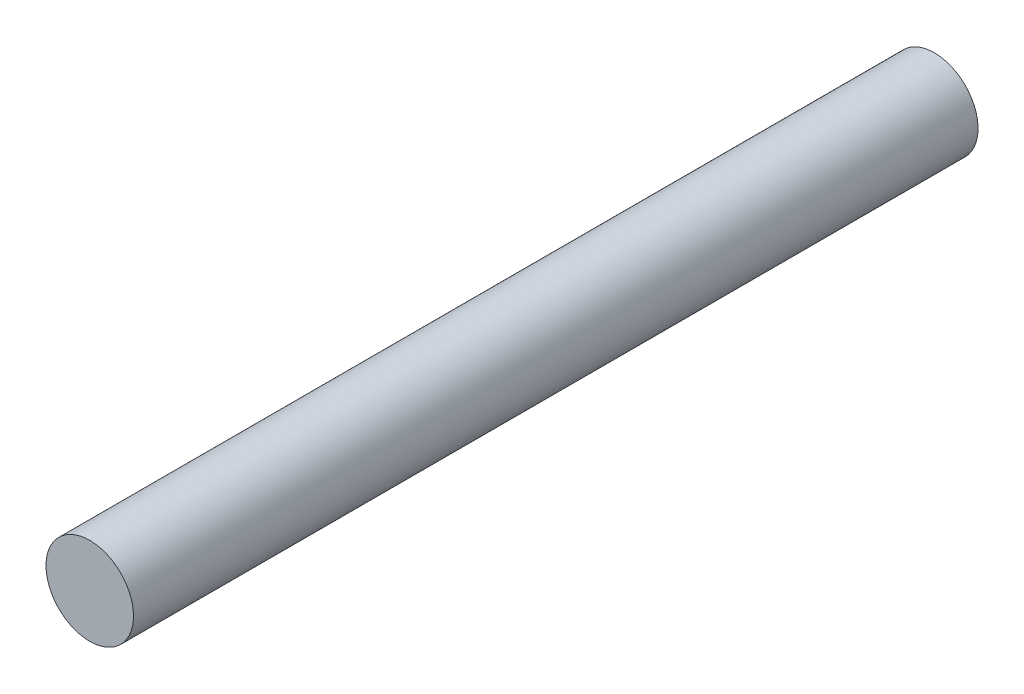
ISO-10303-21;
HEADER;
FILE_DESCRIPTION(('STEP AP214'),'2;1');
FILE_NAME('part.step','',(''),(''),'','','');
FILE_SCHEMA(('AUTOMOTIVE_DESIGN { 1 0 10303 214 1 1 1 1 }'));
ENDSEC;
DATA;
#1=APPLICATION_CONTEXT('core data for automotive mechanical design processes');
#2=APPLICATION_PROTOCOL_DEFINITION('international standard','automotive_design',2000,#1);
#3=PRODUCT_CONTEXT('',#1,'mechanical');
#4=PRODUCT('Part','Part','',(#3));
#5=PRODUCT_RELATED_PRODUCT_CATEGORY('part','',(#4));
#6=PRODUCT_DEFINITION_FORMATION('','',#4);
#7=PRODUCT_DEFINITION_CONTEXT('part definition',#1,'design');
#8=PRODUCT_DEFINITION('design','',#6,#7);
#9=PRODUCT_DEFINITION_SHAPE('','',#8);
#10=(LENGTH_UNIT() NAMED_UNIT(*) SI_UNIT(.MILLI.,.METRE.));
#11=(NAMED_UNIT(*) PLANE_ANGLE_UNIT() SI_UNIT($,.RADIAN.));
#12=(NAMED_UNIT(*) SI_UNIT($,.STERADIAN.) SOLID_ANGLE_UNIT());
#13=UNCERTAINTY_MEASURE_WITH_UNIT(LENGTH_MEASURE(1.E-05),#10,'distance_accuracy_value','');
#14=(GEOMETRIC_REPRESENTATION_CONTEXT(3) GLOBAL_UNCERTAINTY_ASSIGNED_CONTEXT((#13)) GLOBAL_UNIT_ASSIGNED_CONTEXT((#10,
#11,#12)) REPRESENTATION_CONTEXT('',''));
#15=CARTESIAN_POINT('',(0.,0.,0.));
#16=DIRECTION('',(0.,0.,1.));
#17=DIRECTION('',(1.,0.,0.));
#18=AXIS2_PLACEMENT_3D('',#15,#16,#17);
#19=CARTESIAN_POINT('',(0.,0.,30.4));
#20=DIRECTION('',(0.,0.,-1.));
#21=DIRECTION('',(-1.,0.,0.));
#22=AXIS2_PLACEMENT_3D('',#19,#20,#21);
#23=CYLINDRICAL_SURFACE('',#22,3.15);
#24=CARTESIAN_POINT('',(0.,0.,30.4));
#25=DIRECTION('',(0.,0.,1.));
#26=DIRECTION('',(1.,0.,0.));
#27=AXIS2_PLACEMENT_3D('',#24,#25,#26);
#28=CIRCLE('',#27,3.15);
#29=CARTESIAN_POINT('',(-3.15,0.,30.4));
#30=VERTEX_POINT('',#29);
#31=EDGE_CURVE('E10',#30,#30,#28,.T.);
#32=CARTESIAN_POINT('',(0.,0.,-30.4));
#33=DIRECTION('',(0.,0.,1.));
#34=DIRECTION('',(1.,0.,0.));
#35=AXIS2_PLACEMENT_3D('',#32,#33,#34);
#36=CIRCLE('',#35,3.15);
#37=CARTESIAN_POINT('',(-3.15,0.,-30.4));
#38=VERTEX_POINT('',#37);
#39=EDGE_CURVE('E37',#38,#38,#36,.T.);
#40=CARTESIAN_POINT('',(-3.15,0.,30.4));
#41=CARTESIAN_POINT('',(-3.15,0.,29.7666666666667));
#42=CARTESIAN_POINT('',(-3.15,0.,29.1333333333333));
#43=CARTESIAN_POINT('',(-3.15,0.,27.8666666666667));
#44=CARTESIAN_POINT('',(-3.15,0.,27.2333333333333));
#45=CARTESIAN_POINT('',(-3.15,0.,25.9666666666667));
#46=CARTESIAN_POINT('',(-3.15,0.,25.3333333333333));
#47=CARTESIAN_POINT('',(-3.15,0.,24.0666666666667));
#48=CARTESIAN_POINT('',(-3.15,0.,23.4333333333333));
#49=CARTESIAN_POINT('',(-3.15,0.,22.1666666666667));
#50=CARTESIAN_POINT('',(-3.15,0.,21.5333333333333));
#51=CARTESIAN_POINT('',(-3.15,0.,20.2666666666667));
#52=CARTESIAN_POINT('',(-3.15,0.,19.6333333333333));
#53=CARTESIAN_POINT('',(-3.15,0.,18.3666666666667));
#54=CARTESIAN_POINT('',(-3.15,0.,17.7333333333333));
#55=CARTESIAN_POINT('',(-3.15,0.,16.4666666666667));
#56=CARTESIAN_POINT('',(-3.15,0.,15.8333333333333));
#57=CARTESIAN_POINT('',(-3.15,0.,14.5666666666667));
#58=CARTESIAN_POINT('',(-3.15,0.,13.9333333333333));
#59=CARTESIAN_POINT('',(-3.15,0.,12.6666666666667));
#60=CARTESIAN_POINT('',(-3.15,0.,12.0333333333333));
#61=CARTESIAN_POINT('',(-3.15,0.,10.7666666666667));
#62=CARTESIAN_POINT('',(-3.15,0.,10.1333333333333));
#63=CARTESIAN_POINT('',(-3.15,0.,8.86666666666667));
#64=CARTESIAN_POINT('',(-3.15,0.,8.23333333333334));
#65=CARTESIAN_POINT('',(-3.15,0.,6.96666666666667));
#66=CARTESIAN_POINT('',(-3.15,0.,6.33333333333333));
#67=CARTESIAN_POINT('',(-3.15,0.,5.06666666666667));
#68=CARTESIAN_POINT('',(-3.15,0.,4.43333333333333));
#69=CARTESIAN_POINT('',(-3.15,0.,3.16666666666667));
#70=CARTESIAN_POINT('',(-3.15,0.,2.53333333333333));
#71=CARTESIAN_POINT('',(-3.15,0.,1.26666666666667));
#72=CARTESIAN_POINT('',(-3.15,0.,0.633333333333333));
#73=CARTESIAN_POINT('',(-3.15,0.,-0.633333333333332));
#74=CARTESIAN_POINT('',(-3.15,0.,-1.26666666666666));
#75=CARTESIAN_POINT('',(-3.15,0.,-2.53333333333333));
#76=CARTESIAN_POINT('',(-3.15,0.,-3.16666666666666));
#77=CARTESIAN_POINT('',(-3.15,0.,-4.43333333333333));
#78=CARTESIAN_POINT('',(-3.15,0.,-5.06666666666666));
#79=CARTESIAN_POINT('',(-3.15,0.,-6.33333333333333));
#80=CARTESIAN_POINT('',(-3.15,0.,-6.96666666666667));
#81=CARTESIAN_POINT('',(-3.15,0.,-8.23333333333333));
#82=CARTESIAN_POINT('',(-3.15,0.,-8.86666666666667));
#83=CARTESIAN_POINT('',(-3.15,0.,-10.1333333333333));
#84=CARTESIAN_POINT('',(-3.15,0.,-10.7666666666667));
#85=CARTESIAN_POINT('',(-3.15,0.,-12.0333333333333));
#86=CARTESIAN_POINT('',(-3.15,0.,-12.6666666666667));
#87=CARTESIAN_POINT('',(-3.15,0.,-13.9333333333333));
#88=CARTESIAN_POINT('',(-3.15,0.,-14.5666666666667));
#89=CARTESIAN_POINT('',(-3.15,0.,-15.8333333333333));
#90=CARTESIAN_POINT('',(-3.15,0.,-16.4666666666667));
#91=CARTESIAN_POINT('',(-3.15,0.,-17.7333333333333));
#92=CARTESIAN_POINT('',(-3.15,0.,-18.3666666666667));
#93=CARTESIAN_POINT('',(-3.15,0.,-19.6333333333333));
#94=CARTESIAN_POINT('',(-3.15,0.,-20.2666666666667));
#95=CARTESIAN_POINT('',(-3.15,0.,-21.5333333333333));
#96=CARTESIAN_POINT('',(-3.15,0.,-22.1666666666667));
#97=CARTESIAN_POINT('',(-3.15,0.,-23.4333333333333));
#98=CARTESIAN_POINT('',(-3.15,0.,-24.0666666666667));
#99=CARTESIAN_POINT('',(-3.15,0.,-25.3333333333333));
#100=CARTESIAN_POINT('',(-3.15,0.,-25.9666666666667));
#101=CARTESIAN_POINT('',(-3.15,0.,-27.2333333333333));
#102=CARTESIAN_POINT('',(-3.15,0.,-27.8666666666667));
#103=CARTESIAN_POINT('',(-3.15,0.,-29.1333333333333));
#104=CARTESIAN_POINT('',(-3.15,0.,-29.7666666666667));
#105=CARTESIAN_POINT('',(-3.15,0.,-30.4));
#106=B_SPLINE_CURVE_WITH_KNOTS('',3,(#40,#41,#42,#43,#44,#45,#46,#47,#48,#49,#50,#51,#52,#53,
#54,#55,#56,#57,#58,#59,#60,#61,#62,#63,#64,#65,#66,#67,#68,#69,#70,#71,#72,#73,#74,#75,#76,#77,
#78,#79,#80,#81,#82,#83,#84,#85,#86,#87,#88,#89,#90,#91,#92,#93,#94,#95,#96,#97,#98,#99,#100,
#101,#102,#103,#104,#105),.UNSPECIFIED.,.F.,.F.,(4,2,2,2,2,2,2,2,2,2,2,2,2,2,2,2,2,2,2,2,2,2,2,
2,2,2,2,2,2,2,2,2,4),(0.,1.9,3.8,5.7,7.6,9.5,11.4,13.3,15.2,17.1,19.,20.9,22.8,24.7,26.6,28.5,
30.4,32.3,34.2,36.1,38.,39.9,41.8,43.7,45.6,47.5,49.4,51.3,53.2,55.1,57.,58.9,60.8),.UNSPECIFIED.);
#107=EDGE_CURVE('BSEAM34',#30,#38,#106,.T.);
#108=ORIENTED_EDGE('',*,*,#31,.F.);
#109=ORIENTED_EDGE('',*,*,#39,.T.);
#110=ORIENTED_EDGE('',*,*,#107,.T.);
#111=ORIENTED_EDGE('',*,*,#107,.F.);
#112=EDGE_LOOP('',(#108,#110,#109,#111));
#113=FACE_BOUND('',#112,.T.);
#114=ADVANCED_FACE('F34',(#113),#23,.T.);
#115=CARTESIAN_POINT('',(0.,0.,30.4));
#116=DIRECTION('',(0.,0.,1.));
#117=DIRECTION('',(1.,0.,0.));
#118=AXIS2_PLACEMENT_3D('',#115,#116,#117);
#119=PLANE('',#118);
#120=ORIENTED_EDGE('',*,*,#31,.T.);
#121=EDGE_LOOP('',(#120));
#122=FACE_BOUND('',#121,.T.);
#123=ADVANCED_FACE('F49',(#122),#119,.T.);
#124=CARTESIAN_POINT('',(0.,0.,-30.4));
#125=DIRECTION('',(0.,0.,1.));
#126=DIRECTION('',(1.,0.,0.));
#127=AXIS2_PLACEMENT_3D('',#124,#125,#126);
#128=PLANE('',#127);
#129=ORIENTED_EDGE('',*,*,#39,.F.);
#130=EDGE_LOOP('',(#129));
#131=FACE_BOUND('',#130,.T.);
#132=ADVANCED_FACE('F47',(#131),#128,.F.);
#133=CLOSED_SHELL('',(#114,#123,#132));
#134=MANIFOLD_SOLID_BREP('B2',#133);
#135=ADVANCED_BREP_SHAPE_REPRESENTATION('',(#18,#134),#14);
#136=SHAPE_DEFINITION_REPRESENTATION(#9,#135);
ENDSEC;
END-ISO-10303-21;
